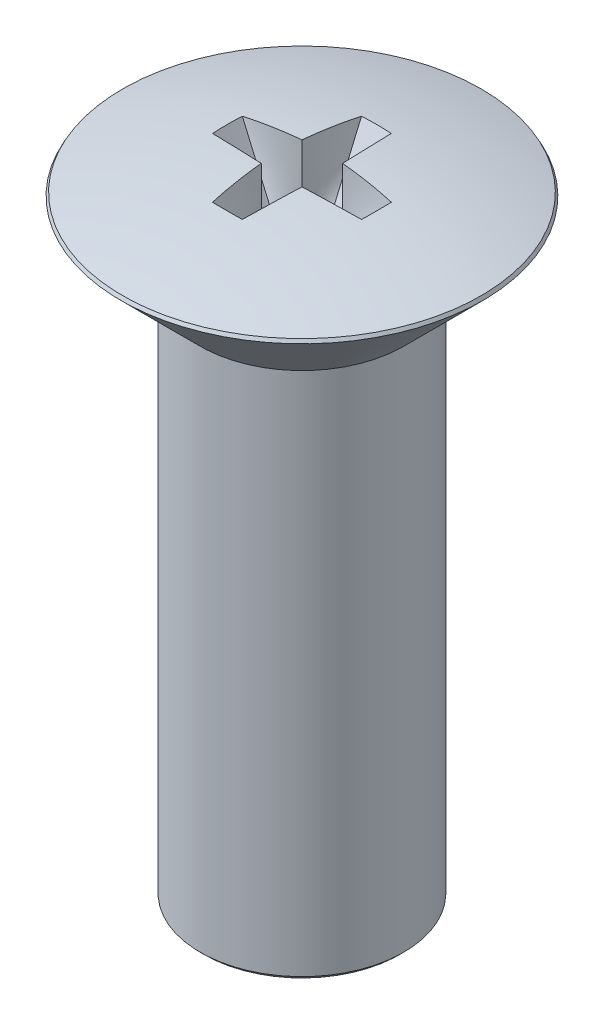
from build123d import *
from build123d.topology import SkipClean

# Parameters (mm, degrees)
CHANFREIN_SUP_SIZE  = 0.1
CHANFREIN_SUP_SIZE2 = 0.073824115
CHANFREIN_INF_SIZE  = 0.1
C_NE_SUP_ANGLE      = 180


with BuildPart() as part:
    # Esquisse1 → Base-R_volution (revolve)
    with BuildSketch(Plane.XY, mode=Mode.PRIVATE) as base_r_volution_sk:
        with BuildLine():
            Line((2.5, 0), (2.5, 13))
            Line((2.5, 13), (4.5, 15))
            ThreePointArc((4.5, 15), (2.274104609, 15.494465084), (0, 15.660459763))
            Line((0, 15.660459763), (0, 0))
            Line((0, 0), (2.5, 0))
        make_face()
    revolve(base_r_volution_sk.sketch.rotate(Axis((0, 0, 0), (0, 1, 0)), 90), axis=Axis((0, 0, 0), (0, 1, 0)))

    # Esquisse3 → Empreinte t_te vis section 0
    with BuildSketch(Plane(origin=(0, 16.66, 0), x_dir=(-1, 0, 0), z_dir=(0, 1, 0))):
        with BuildLine():
            Line((-0.5, 2.5), (0.5, 2.5))
            Line((0.5, 2.5), (0.5, 0.5))
            Line((0.5, 0.5), (2.5, 0.5))
            Line((2.5, 0.5), (2.5, -0.5))
            Line((2.5, -0.5), (0.5, -0.5))
            Line((0.5, -0.5), (0.5, -2.5))
            Line((0.5, -2.5), (-0.5, -2.5))
            Line((-0.5, -2.5), (-0.5, -0.5))
            Line((-0.5, -0.5), (-2.5, -0.5))
            Line((-2.5, -0.5), (-2.5, 0.5))
            Line((-2.5, 0.5), (-0.5, 0.5))
            Line((-0.5, 0.5), (-0.5, 2.5))
        make_face()
    # Esquisse8 for Empreinte t → Empreinte t_te vis section 1
    with BuildSketch(Plane(origin=(0, 13.66, 0), x_dir=(-1, 0, 0), z_dir=(0, 1, 0))):
        with BuildLine():
            # circular arc as an exact rational Bezier (weights 1, cos(half-angle), 1)
            Bezier((-0.138675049, 0.693375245), (0, 0.721110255), (0.138675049, 0.693375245), weights=[1, 0.980580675, 1])
            Bezier((0.138675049, 0.693375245), (0.348612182, 0.65138782), (0.5, 0.5), weights=[1, 0.957092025, 1])
            Bezier((0.5, 0.5), (0.65138782, 0.348612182), (0.693375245, 0.138675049), weights=[1, 0.957092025, 1])
            Bezier((0.693375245, 0.138675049), (0.721110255, 0), (0.693375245, -0.138675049), weights=[1, 0.980580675, 1])
            Bezier((0.693375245, -0.138675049), (0.65138782, -0.348612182), (0.5, -0.5), weights=[1, 0.957092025, 1])
            Bezier((0.5, -0.5), (0.348612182, -0.65138782), (0.138675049, -0.693375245), weights=[1, 0.957092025, 1])
            Bezier((0.138675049, -0.693375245), (0, -0.721110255), (-0.138675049, -0.693375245), weights=[1, 0.980580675, 1])
            Bezier((-0.138675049, -0.693375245), (-0.348612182, -0.65138782), (-0.5, -0.5), weights=[1, 0.957092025, 1])
            Bezier((-0.5, -0.5), (-0.65138782, -0.348612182), (-0.693375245, -0.138675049), weights=[1, 0.957092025, 1])
            Bezier((-0.693375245, -0.138675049), (-0.721110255, 0), (-0.693375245, 0.138675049), weights=[1, 0.980580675, 1])
            Bezier((-0.693375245, 0.138675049), (-0.65138782, 0.348612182), (-0.5, 0.5), weights=[1, 0.957092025, 1])
            Bezier((-0.5, 0.5), (-0.348612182, 0.65138782), (-0.138675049, 0.693375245), weights=[1, 0.957092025, 1])
        make_face()
    loft(mode=Mode.SUBTRACT)

    # Chanfrein sup
    chanfrein_sup_edges = [part.edges().sort_by_distance(p)[0] for p in [
        (0, 15, 4.5),
    ]]
    chanfrein_sup_side = [part.faces().sort_by_distance(p)[0] for p in [
        (0, 15.43916023, 2.623419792),
    ]]
    chamfer(chanfrein_sup_edges, length=CHANFREIN_SUP_SIZE, length2=CHANFREIN_SUP_SIZE2, reference=chanfrein_sup_side[0])

    # Chanfrein inf
    chanfrein_inf_edges = [part.edges().sort_by_distance(p)[0] for p in [
        (0, 0, 2.5),
    ]]
    chamfer(chanfrein_inf_edges, length=CHANFREIN_INF_SIZE)

    # Esquisse9 → C_ne sup (revolve, cut)
    with BuildSketch(Plane.XY):
        Polygon((0.700241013, 13.66), (0.1, 11.16), (0, 11.16), (0, 13.66), align=None)
    c_ne_sup = revolve(axis=Axis((0, 0, 0), (0, 1, 0)), revolution_arc=C_NE_SUP_ANGLE, mode=Mode.SUBTRACT)

    # Sym_trie1: C_ne sup across plane
    with SkipClean():  # the faces are left unmerged after this step: merging them gives an invalid solid
        add(c_ne_sup.mirror(Plane.XY), mode=Mode.SUBTRACT)


solid = part.part
